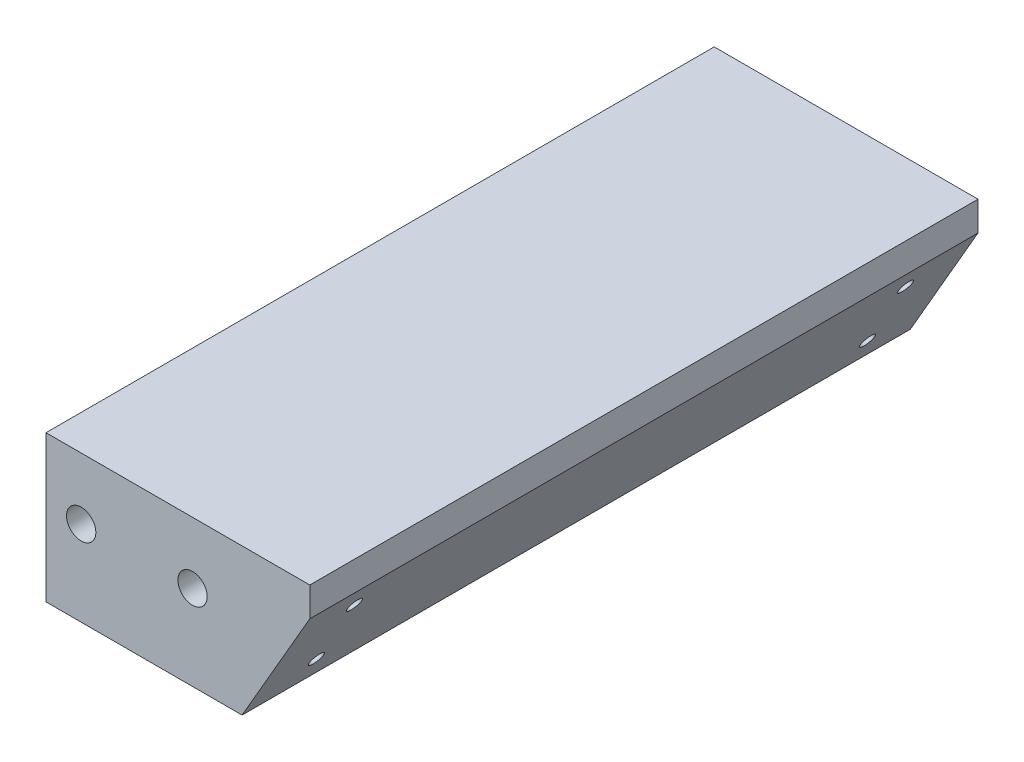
ISO-10303-21;
HEADER;
FILE_DESCRIPTION(('STEP AP214'),'2;1');
FILE_NAME('part.step','',(''),(''),'','','');
FILE_SCHEMA(('AUTOMOTIVE_DESIGN { 1 0 10303 214 1 1 1 1 }'));
ENDSEC;
DATA;
#1=APPLICATION_CONTEXT('core data for automotive mechanical design processes');
#2=APPLICATION_PROTOCOL_DEFINITION('international standard','automotive_design',2000,#1);
#3=PRODUCT_CONTEXT('',#1,'mechanical');
#4=PRODUCT('Part','Part','',(#3));
#5=PRODUCT_RELATED_PRODUCT_CATEGORY('part','',(#4));
#6=PRODUCT_DEFINITION_FORMATION('','',#4);
#7=PRODUCT_DEFINITION_CONTEXT('part definition',#1,'design');
#8=PRODUCT_DEFINITION('design','',#6,#7);
#9=PRODUCT_DEFINITION_SHAPE('','',#8);
#10=(LENGTH_UNIT() NAMED_UNIT(*) SI_UNIT(.MILLI.,.METRE.));
#11=(NAMED_UNIT(*) PLANE_ANGLE_UNIT() SI_UNIT($,.RADIAN.));
#12=(NAMED_UNIT(*) SI_UNIT($,.STERADIAN.) SOLID_ANGLE_UNIT());
#13=UNCERTAINTY_MEASURE_WITH_UNIT(LENGTH_MEASURE(1.E-05),#10,'distance_accuracy_value','');
#14=(GEOMETRIC_REPRESENTATION_CONTEXT(3) GLOBAL_UNCERTAINTY_ASSIGNED_CONTEXT((#13)) GLOBAL_UNIT_ASSIGNED_CONTEXT((#10,
#11,#12)) REPRESENTATION_CONTEXT('',''));
#15=CARTESIAN_POINT('',(0.,0.,0.));
#16=DIRECTION('',(0.,0.,1.));
#17=DIRECTION('',(1.,0.,0.));
#18=AXIS2_PLACEMENT_3D('',#15,#16,#17);
#19=CARTESIAN_POINT('',(45.,0.,57.));
#20=DIRECTION('',(0.,-1.,0.));
#21=DIRECTION('',(1.,0.,0.));
#22=AXIS2_PLACEMENT_3D('',#19,#20,#21);
#23=PLANE('',#22);
#24=DIRECTION('',(-1.,0.,0.));
#25=VECTOR('',#24,1.);
#26=CARTESIAN_POINT('',(45.,0.,-57.));
#27=LINE('',#26,#25);
#28=CARTESIAN_POINT('',(45.,0.,-57.));
#29=VERTEX_POINT('',#28);
#30=CARTESIAN_POINT('',(0.,0.,-57.));
#31=VERTEX_POINT('',#30);
#32=EDGE_CURVE('E113',#29,#31,#27,.T.);
#33=ORIENTED_EDGE('',*,*,#32,.T.);
#34=DIRECTION('',(0.,0.,-1.));
#35=VECTOR('',#34,1.);
#36=CARTESIAN_POINT('',(0.,0.,57.));
#37=LINE('',#36,#35);
#38=CARTESIAN_POINT('',(0.,0.,57.));
#39=VERTEX_POINT('',#38);
#40=EDGE_CURVE('E11',#39,#31,#37,.T.);
#41=ORIENTED_EDGE('',*,*,#40,.F.);
#42=DIRECTION('',(-1.,0.,0.));
#43=VECTOR('',#42,1.);
#44=CARTESIAN_POINT('',(45.,0.,57.));
#45=LINE('',#44,#43);
#46=CARTESIAN_POINT('',(45.,0.,57.));
#47=VERTEX_POINT('',#46);
#48=EDGE_CURVE('E122',#47,#39,#45,.T.);
#49=ORIENTED_EDGE('',*,*,#48,.F.);
#50=DIRECTION('',(0.,0.,-1.));
#51=VECTOR('',#50,1.);
#52=CARTESIAN_POINT('',(45.,0.,57.));
#53=LINE('',#52,#51);
#54=EDGE_CURVE('E109',#47,#29,#53,.T.);
#55=ORIENTED_EDGE('',*,*,#54,.T.);
#56=EDGE_LOOP('',(#33,#41,#49,#55));
#57=FACE_BOUND('',#56,.T.);
#58=ADVANCED_FACE('F36',(#57),#23,.F.);
#59=CARTESIAN_POINT('',(0.,0.,57.));
#60=DIRECTION('',(1.,0.,0.));
#61=DIRECTION('',(0.,1.,0.));
#62=AXIS2_PLACEMENT_3D('',#59,#60,#61);
#63=PLANE('',#62);
#64=DIRECTION('',(0.,-1.,0.));
#65=VECTOR('',#64,1.);
#66=CARTESIAN_POINT('',(0.,0.,-57.));
#67=LINE('',#66,#65);
#68=CARTESIAN_POINT('',(0.,-25.,-57.));
#69=VERTEX_POINT('',#68);
#70=EDGE_CURVE('E116',#31,#69,#67,.T.);
#71=ORIENTED_EDGE('',*,*,#70,.T.);
#72=DIRECTION('',(0.,0.,-1.));
#73=VECTOR('',#72,1.);
#74=CARTESIAN_POINT('',(0.,-25.,57.));
#75=LINE('',#74,#73);
#76=CARTESIAN_POINT('',(0.,-25.,57.));
#77=VERTEX_POINT('',#76);
#78=EDGE_CURVE('E44',#77,#69,#75,.T.);
#79=ORIENTED_EDGE('',*,*,#78,.F.);
#80=DIRECTION('',(0.,-1.,0.));
#81=VECTOR('',#80,1.);
#82=CARTESIAN_POINT('',(0.,0.,57.));
#83=LINE('',#82,#81);
#84=EDGE_CURVE('E87',#39,#77,#83,.T.);
#85=ORIENTED_EDGE('',*,*,#84,.F.);
#86=ORIENTED_EDGE('',*,*,#40,.T.);
#87=EDGE_LOOP('',(#71,#79,#85,#86));
#88=FACE_BOUND('',#87,.T.);
#89=ADVANCED_FACE('F143',(#88),#63,.F.);
#90=CARTESIAN_POINT('',(0.,-25.,57.));
#91=DIRECTION('',(0.,1.,0.));
#92=DIRECTION('',(0.,0.,1.));
#93=AXIS2_PLACEMENT_3D('',#90,#91,#92);
#94=PLANE('',#93);
#95=DIRECTION('',(1.,0.,0.));
#96=VECTOR('',#95,1.);
#97=CARTESIAN_POINT('',(0.,-25.,-57.));
#98=LINE('',#97,#96);
#99=CARTESIAN_POINT('',(33.4529946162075,-25.,-57.));
#100=VERTEX_POINT('',#99);
#101=EDGE_CURVE('E104',#69,#100,#98,.T.);
#102=ORIENTED_EDGE('',*,*,#101,.T.);
#103=DIRECTION('',(0.,0.,-1.));
#104=VECTOR('',#103,1.);
#105=CARTESIAN_POINT('',(33.4529946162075,-25.,57.));
#106=LINE('',#105,#104);
#107=CARTESIAN_POINT('',(33.4529946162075,-25.,57.));
#108=VERTEX_POINT('',#107);
#109=EDGE_CURVE('E101',#108,#100,#106,.T.);
#110=ORIENTED_EDGE('',*,*,#109,.F.);
#111=DIRECTION('',(1.,0.,0.));
#112=VECTOR('',#111,1.);
#113=CARTESIAN_POINT('',(0.,-25.,57.));
#114=LINE('',#113,#112);
#115=EDGE_CURVE('E93',#77,#108,#114,.T.);
#116=ORIENTED_EDGE('',*,*,#115,.F.);
#117=ORIENTED_EDGE('',*,*,#78,.T.);
#118=EDGE_LOOP('',(#102,#110,#116,#117));
#119=FACE_BOUND('',#118,.T.);
#120=ADVANCED_FACE('F102',(#119),#94,.F.);
#121=CARTESIAN_POINT('',(33.4529946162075,-25.,57.));
#122=DIRECTION('',(-0.86602540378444,0.499999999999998,0.));
#123=DIRECTION('',(-0.499999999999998,-0.86602540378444,0.));
#124=AXIS2_PLACEMENT_3D('',#121,#122,#123);
#125=PLANE('',#124);
#126=CARTESIAN_POINT('',(42.6188021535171,-9.12435565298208,47.));
#127=DIRECTION('',(0.86602540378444,-0.499999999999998,0.));
#128=DIRECTION('',(0.499999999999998,0.86602540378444,0.));
#129=AXIS2_PLACEMENT_3D('',#126,#127,#128);
#130=CIRCLE('',#129,1.24999999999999);
#131=CARTESIAN_POINT('',(43.2438021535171,-8.04182389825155,47.));
#132=VERTEX_POINT('',#131);
#133=EDGE_CURVE('E423',#132,#132,#130,.T.);
#134=ORIENTED_EDGE('',*,*,#133,.F.);
#135=EDGE_LOOP('',(#134));
#136=FACE_BOUND('',#135,.T.);
#137=CARTESIAN_POINT('',(42.6188021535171,-9.12435565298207,-47.));
#138=DIRECTION('',(0.86602540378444,-0.499999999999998,0.));
#139=DIRECTION('',(0.499999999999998,0.86602540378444,0.));
#140=AXIS2_PLACEMENT_3D('',#137,#138,#139);
#141=CIRCLE('',#140,1.24999999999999);
#142=CARTESIAN_POINT('',(43.2438021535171,-8.04182389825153,-47.));
#143=VERTEX_POINT('',#142);
#144=EDGE_CURVE('E417',#143,#143,#141,.T.);
#145=ORIENTED_EDGE('',*,*,#144,.F.);
#146=EDGE_LOOP('',(#145));
#147=FACE_BOUND('',#146,.T.);
#148=CARTESIAN_POINT('',(36.1295104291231,-20.3641386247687,-47.));
#149=DIRECTION('',(0.86602540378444,-0.499999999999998,0.));
#150=DIRECTION('',(0.499999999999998,0.86602540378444,0.));
#151=AXIS2_PLACEMENT_3D('',#148,#149,#150);
#152=CIRCLE('',#151,1.24999999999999);
#153=CARTESIAN_POINT('',(36.7545104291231,-19.2816068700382,-47.));
#154=VERTEX_POINT('',#153);
#155=EDGE_CURVE('E411',#154,#154,#152,.T.);
#156=ORIENTED_EDGE('',*,*,#155,.F.);
#157=EDGE_LOOP('',(#156));
#158=FACE_BOUND('',#157,.T.);
#159=CARTESIAN_POINT('',(36.1295104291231,-20.3641386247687,47.));
#160=DIRECTION('',(0.86602540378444,-0.499999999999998,0.));
#161=DIRECTION('',(0.499999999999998,0.86602540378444,0.));
#162=AXIS2_PLACEMENT_3D('',#159,#160,#161);
#163=CIRCLE('',#162,1.24999999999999);
#164=CARTESIAN_POINT('',(36.7545104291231,-19.2816068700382,47.));
#165=VERTEX_POINT('',#164);
#166=EDGE_CURVE('E405',#165,#165,#163,.T.);
#167=ORIENTED_EDGE('',*,*,#166,.F.);
#168=EDGE_LOOP('',(#167));
#169=FACE_BOUND('',#168,.T.);
#170=DIRECTION('',(0.499999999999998,0.86602540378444,0.));
#171=VECTOR('',#170,1.);
#172=CARTESIAN_POINT('',(33.4529946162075,-25.,-57.));
#173=LINE('',#172,#171);
#174=CARTESIAN_POINT('',(45.,-5.,-57.));
#175=VERTEX_POINT('',#174);
#176=EDGE_CURVE('E73',#100,#175,#173,.T.);
#177=ORIENTED_EDGE('',*,*,#176,.T.);
#178=DIRECTION('',(0.,0.,-1.));
#179=VECTOR('',#178,1.);
#180=CARTESIAN_POINT('',(45.,-5.,57.));
#181=LINE('',#180,#179);
#182=CARTESIAN_POINT('',(45.,-5.,57.));
#183=VERTEX_POINT('',#182);
#184=EDGE_CURVE('E105',#183,#175,#181,.T.);
#185=ORIENTED_EDGE('',*,*,#184,.F.);
#186=DIRECTION('',(0.499999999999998,0.86602540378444,0.));
#187=VECTOR('',#186,1.);
#188=CARTESIAN_POINT('',(33.4529946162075,-25.,57.));
#189=LINE('',#188,#187);
#190=EDGE_CURVE('E97',#108,#183,#189,.T.);
#191=ORIENTED_EDGE('',*,*,#190,.F.);
#192=ORIENTED_EDGE('',*,*,#109,.T.);
#193=EDGE_LOOP('',(#177,#185,#191,#192));
#194=FACE_BOUND('',#193,.T.);
#195=ADVANCED_FACE('F107',(#136,#147,#158,#169,#194),#125,.F.);
#196=CARTESIAN_POINT('',(45.,-5.,57.));
#197=DIRECTION('',(-1.,0.,0.));
#198=DIRECTION('',(0.,0.,1.));
#199=AXIS2_PLACEMENT_3D('',#196,#197,#198);
#200=PLANE('',#199);
#201=DIRECTION('',(0.,1.,0.));
#202=VECTOR('',#201,1.);
#203=CARTESIAN_POINT('',(45.,-5.,-57.));
#204=LINE('',#203,#202);
#205=EDGE_CURVE('E79',#175,#29,#204,.T.);
#206=ORIENTED_EDGE('',*,*,#205,.T.);
#207=ORIENTED_EDGE('',*,*,#54,.F.);
#208=DIRECTION('',(0.,1.,0.));
#209=VECTOR('',#208,1.);
#210=CARTESIAN_POINT('',(45.,-5.,57.));
#211=LINE('',#210,#209);
#212=EDGE_CURVE('E52',#183,#47,#211,.T.);
#213=ORIENTED_EDGE('',*,*,#212,.F.);
#214=ORIENTED_EDGE('',*,*,#184,.T.);
#215=EDGE_LOOP('',(#206,#207,#213,#214));
#216=FACE_BOUND('',#215,.T.);
#217=ADVANCED_FACE('F130',(#216),#200,.F.);
#218=CARTESIAN_POINT('',(0.,0.,57.));
#219=DIRECTION('',(0.,0.,1.));
#220=DIRECTION('',(1.,0.,0.));
#221=AXIS2_PLACEMENT_3D('',#218,#219,#220);
#222=PLANE('',#221);
#223=CARTESIAN_POINT('',(25.,-10.5,57.));
#224=DIRECTION('',(0.,0.,1.));
#225=DIRECTION('',(1.,0.,0.));
#226=AXIS2_PLACEMENT_3D('',#223,#224,#225);
#227=CIRCLE('',#226,2.49999999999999);
#228=CARTESIAN_POINT('',(27.5,-10.5,57.));
#229=VERTEX_POINT('',#228);
#230=EDGE_CURVE('E376',#229,#229,#227,.T.);
#231=ORIENTED_EDGE('',*,*,#230,.F.);
#232=EDGE_LOOP('',(#231));
#233=FACE_BOUND('',#232,.T.);
#234=CARTESIAN_POINT('',(6.,-10.5,57.));
#235=DIRECTION('',(0.,0.,1.));
#236=DIRECTION('',(1.,0.,0.));
#237=AXIS2_PLACEMENT_3D('',#234,#235,#236);
#238=CIRCLE('',#237,2.49999999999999);
#239=CARTESIAN_POINT('',(8.49999999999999,-10.5,57.));
#240=VERTEX_POINT('',#239);
#241=EDGE_CURVE('E387',#240,#240,#238,.T.);
#242=ORIENTED_EDGE('',*,*,#241,.F.);
#243=EDGE_LOOP('',(#242));
#244=FACE_BOUND('',#243,.T.);
#245=ORIENTED_EDGE('',*,*,#48,.T.);
#246=ORIENTED_EDGE('',*,*,#84,.T.);
#247=ORIENTED_EDGE('',*,*,#115,.T.);
#248=ORIENTED_EDGE('',*,*,#190,.T.);
#249=ORIENTED_EDGE('',*,*,#212,.T.);
#250=EDGE_LOOP('',(#245,#246,#247,#248,#249));
#251=FACE_BOUND('',#250,.T.);
#252=ADVANCED_FACE('F95',(#233,#244,#251),#222,.T.);
#253=CARTESIAN_POINT('',(0.,0.,-57.));
#254=DIRECTION('',(0.,0.,1.));
#255=DIRECTION('',(1.,0.,0.));
#256=AXIS2_PLACEMENT_3D('',#253,#254,#255);
#257=PLANE('',#256);
#258=CARTESIAN_POINT('',(25.,-10.5,-57.));
#259=DIRECTION('',(0.,0.,-1.));
#260=DIRECTION('',(-1.,0.,0.));
#261=AXIS2_PLACEMENT_3D('',#258,#259,#260);
#262=CIRCLE('',#261,2.49999999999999);
#263=CARTESIAN_POINT('',(22.5,-10.5,-57.));
#264=VERTEX_POINT('',#263);
#265=EDGE_CURVE('E367',#264,#264,#262,.T.);
#266=ORIENTED_EDGE('',*,*,#265,.F.);
#267=EDGE_LOOP('',(#266));
#268=FACE_BOUND('',#267,.T.);
#269=CARTESIAN_POINT('',(6.,-10.5,-57.));
#270=DIRECTION('',(0.,0.,-1.));
#271=DIRECTION('',(-1.,0.,0.));
#272=AXIS2_PLACEMENT_3D('',#269,#270,#271);
#273=CIRCLE('',#272,2.49999999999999);
#274=CARTESIAN_POINT('',(3.50000000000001,-10.5,-57.));
#275=VERTEX_POINT('',#274);
#276=EDGE_CURVE('E370',#275,#275,#273,.T.);
#277=ORIENTED_EDGE('',*,*,#276,.F.);
#278=EDGE_LOOP('',(#277));
#279=FACE_BOUND('',#278,.T.);
#280=ORIENTED_EDGE('',*,*,#32,.F.);
#281=ORIENTED_EDGE('',*,*,#205,.F.);
#282=ORIENTED_EDGE('',*,*,#176,.F.);
#283=ORIENTED_EDGE('',*,*,#101,.F.);
#284=ORIENTED_EDGE('',*,*,#70,.F.);
#285=EDGE_LOOP('',(#280,#281,#282,#283,#284));
#286=FACE_BOUND('',#285,.T.);
#287=ADVANCED_FACE('F126',(#268,#279,#286),#257,.F.);
#288=CARTESIAN_POINT('',(6.,-10.5,42.));
#289=DIRECTION('',(0.,0.,1.));
#290=DIRECTION('',(1.,0.,0.));
#291=AXIS2_PLACEMENT_3D('',#288,#289,#290);
#292=CONICAL_SURFACE('',#291,2.49999999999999,1.02974425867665);
#293=CARTESIAN_POINT('',(5.99999999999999,-10.5,40.4978484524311));
#294=VERTEX_POINT('',#293);
#295=VERTEX_LOOP('',#294);
#296=FACE_BOUND('',#295,.T.);
#297=CARTESIAN_POINT('',(6.,-10.5,42.));
#298=DIRECTION('',(0.,0.,1.));
#299=DIRECTION('',(1.,0.,0.));
#300=AXIS2_PLACEMENT_3D('',#297,#298,#299);
#301=CIRCLE('',#300,2.49999999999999);
#302=CARTESIAN_POINT('',(8.49999999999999,-10.5,42.));
#303=VERTEX_POINT('',#302);
#304=EDGE_CURVE('E117',#303,#303,#301,.T.);
#305=ORIENTED_EDGE('',*,*,#304,.T.);
#306=EDGE_LOOP('',(#305));
#307=FACE_BOUND('',#306,.T.);
#308=ADVANCED_FACE('F286',(#296,#307),#292,.F.);
#309=CARTESIAN_POINT('',(6.,-10.5,57.));
#310=DIRECTION('',(0.,0.,1.));
#311=DIRECTION('',(1.,0.,0.));
#312=AXIS2_PLACEMENT_3D('',#309,#310,#311);
#313=CYLINDRICAL_SURFACE('',#312,2.49999999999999);
#314=ORIENTED_EDGE('',*,*,#304,.F.);
#315=EDGE_LOOP('',(#314));
#316=FACE_BOUND('',#315,.T.);
#317=ORIENTED_EDGE('',*,*,#241,.T.);
#318=EDGE_LOOP('',(#317));
#319=FACE_BOUND('',#318,.T.);
#320=ADVANCED_FACE('F280',(#316,#319),#313,.F.);
#321=CARTESIAN_POINT('',(25.,-10.5,42.));
#322=DIRECTION('',(0.,0.,1.));
#323=DIRECTION('',(1.,0.,0.));
#324=AXIS2_PLACEMENT_3D('',#321,#322,#323);
#325=CONICAL_SURFACE('',#324,2.49999999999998,1.02974425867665);
#326=CARTESIAN_POINT('',(25.,-10.5,40.4978484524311));
#327=VERTEX_POINT('',#326);
#328=VERTEX_LOOP('',#327);
#329=FACE_BOUND('',#328,.T.);
#330=CARTESIAN_POINT('',(25.,-10.5,42.));
#331=DIRECTION('',(0.,0.,1.));
#332=DIRECTION('',(1.,0.,0.));
#333=AXIS2_PLACEMENT_3D('',#330,#331,#332);
#334=CIRCLE('',#333,2.49999999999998);
#335=CARTESIAN_POINT('',(27.5,-10.5,42.));
#336=VERTEX_POINT('',#335);
#337=EDGE_CURVE('E384',#336,#336,#334,.T.);
#338=ORIENTED_EDGE('',*,*,#337,.T.);
#339=EDGE_LOOP('',(#338));
#340=FACE_BOUND('',#339,.T.);
#341=ADVANCED_FACE('F285',(#329,#340),#325,.F.);
#342=CARTESIAN_POINT('',(25.,-10.5,57.));
#343=DIRECTION('',(0.,0.,1.));
#344=DIRECTION('',(1.,0.,0.));
#345=AXIS2_PLACEMENT_3D('',#342,#343,#344);
#346=CYLINDRICAL_SURFACE('',#345,2.49999999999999);
#347=ORIENTED_EDGE('',*,*,#337,.F.);
#348=EDGE_LOOP('',(#347));
#349=FACE_BOUND('',#348,.T.);
#350=ORIENTED_EDGE('',*,*,#230,.T.);
#351=EDGE_LOOP('',(#350));
#352=FACE_BOUND('',#351,.T.);
#353=ADVANCED_FACE('F294',(#349,#352),#346,.F.);
#354=CARTESIAN_POINT('',(6.,-10.5,-42.));
#355=DIRECTION('',(0.,0.,-1.));
#356=DIRECTION('',(-1.,0.,0.));
#357=AXIS2_PLACEMENT_3D('',#354,#355,#356);
#358=CONICAL_SURFACE('',#357,2.49999999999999,1.02974425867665);
#359=CARTESIAN_POINT('',(5.99999999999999,-10.5,-40.4978484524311));
#360=VERTEX_POINT('',#359);
#361=VERTEX_LOOP('',#360);
#362=FACE_BOUND('',#361,.T.);
#363=CARTESIAN_POINT('',(6.,-10.5,-42.));
#364=DIRECTION('',(0.,0.,-1.));
#365=DIRECTION('',(-1.,0.,0.));
#366=AXIS2_PLACEMENT_3D('',#363,#364,#365);
#367=CIRCLE('',#366,2.49999999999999);
#368=CARTESIAN_POINT('',(3.50000000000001,-10.5,-42.));
#369=VERTEX_POINT('',#368);
#370=EDGE_CURVE('E372',#369,#369,#367,.T.);
#371=ORIENTED_EDGE('',*,*,#370,.T.);
#372=EDGE_LOOP('',(#371));
#373=FACE_BOUND('',#372,.T.);
#374=ADVANCED_FACE('F265',(#362,#373),#358,.F.);
#375=CARTESIAN_POINT('',(6.,-10.5,-57.));
#376=DIRECTION('',(0.,0.,-1.));
#377=DIRECTION('',(-1.,0.,0.));
#378=AXIS2_PLACEMENT_3D('',#375,#376,#377);
#379=CYLINDRICAL_SURFACE('',#378,2.49999999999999);
#380=ORIENTED_EDGE('',*,*,#370,.F.);
#381=EDGE_LOOP('',(#380));
#382=FACE_BOUND('',#381,.T.);
#383=ORIENTED_EDGE('',*,*,#276,.T.);
#384=EDGE_LOOP('',(#383));
#385=FACE_BOUND('',#384,.T.);
#386=ADVANCED_FACE('F259',(#382,#385),#379,.F.);
#387=CARTESIAN_POINT('',(25.,-10.5,-42.));
#388=DIRECTION('',(0.,0.,-1.));
#389=DIRECTION('',(-1.,0.,0.));
#390=AXIS2_PLACEMENT_3D('',#387,#388,#389);
#391=CONICAL_SURFACE('',#390,2.49999999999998,1.02974425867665);
#392=CARTESIAN_POINT('',(25.,-10.5,-40.4978484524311));
#393=VERTEX_POINT('',#392);
#394=VERTEX_LOOP('',#393);
#395=FACE_BOUND('',#394,.T.);
#396=CARTESIAN_POINT('',(25.,-10.5,-42.));
#397=DIRECTION('',(0.,0.,-1.));
#398=DIRECTION('',(-1.,0.,0.));
#399=AXIS2_PLACEMENT_3D('',#396,#397,#398);
#400=CIRCLE('',#399,2.49999999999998);
#401=CARTESIAN_POINT('',(22.5,-10.5,-42.));
#402=VERTEX_POINT('',#401);
#403=EDGE_CURVE('E373',#402,#402,#400,.T.);
#404=ORIENTED_EDGE('',*,*,#403,.T.);
#405=EDGE_LOOP('',(#404));
#406=FACE_BOUND('',#405,.T.);
#407=ADVANCED_FACE('F264',(#395,#406),#391,.F.);
#408=CARTESIAN_POINT('',(25.,-10.5,-57.));
#409=DIRECTION('',(0.,0.,-1.));
#410=DIRECTION('',(-1.,0.,0.));
#411=AXIS2_PLACEMENT_3D('',#408,#409,#410);
#412=CYLINDRICAL_SURFACE('',#411,2.49999999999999);
#413=ORIENTED_EDGE('',*,*,#403,.F.);
#414=EDGE_LOOP('',(#413));
#415=FACE_BOUND('',#414,.T.);
#416=ORIENTED_EDGE('',*,*,#265,.T.);
#417=EDGE_LOOP('',(#416));
#418=FACE_BOUND('',#417,.T.);
#419=ADVANCED_FACE('F164',(#415,#418),#412,.F.);
#420=CARTESIAN_POINT('',(25.7372055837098,-14.3641386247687,47.));
#421=DIRECTION('',(0.86602540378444,-0.499999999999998,0.));
#422=DIRECTION('',(0.499999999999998,0.86602540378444,0.));
#423=AXIS2_PLACEMENT_3D('',#420,#421,#422);
#424=CONICAL_SURFACE('',#423,1.24999999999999,1.02974425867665);
#425=CARTESIAN_POINT('',(25.0867548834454,-13.9886007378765,47.));
#426=VERTEX_POINT('',#425);
#427=VERTEX_LOOP('',#426);
#428=FACE_BOUND('',#427,.T.);
#429=CARTESIAN_POINT('',(25.7372055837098,-14.3641386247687,47.));
#430=DIRECTION('',(0.86602540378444,-0.499999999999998,0.));
#431=DIRECTION('',(0.499999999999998,0.86602540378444,0.));
#432=AXIS2_PLACEMENT_3D('',#429,#430,#431);
#433=CIRCLE('',#432,1.24999999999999);
#434=CARTESIAN_POINT('',(26.3622055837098,-13.2816068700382,47.));
#435=VERTEX_POINT('',#434);
#436=EDGE_CURVE('E402',#435,#435,#433,.T.);
#437=ORIENTED_EDGE('',*,*,#436,.T.);
#438=EDGE_LOOP('',(#437));
#439=FACE_BOUND('',#438,.T.);
#440=ADVANCED_FACE('F169',(#428,#439),#424,.F.);
#441=CARTESIAN_POINT('',(36.1295104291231,-20.3641386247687,47.));
#442=DIRECTION('',(0.86602540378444,-0.499999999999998,0.));
#443=DIRECTION('',(0.499999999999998,0.86602540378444,0.));
#444=AXIS2_PLACEMENT_3D('',#441,#442,#443);
#445=CYLINDRICAL_SURFACE('',#444,1.24999999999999);
#446=ORIENTED_EDGE('',*,*,#436,.F.);
#447=EDGE_LOOP('',(#446));
#448=FACE_BOUND('',#447,.T.);
#449=ORIENTED_EDGE('',*,*,#166,.T.);
#450=EDGE_LOOP('',(#449));
#451=FACE_BOUND('',#450,.T.);
#452=ADVANCED_FACE('F174',(#448,#451),#445,.F.);
#453=CARTESIAN_POINT('',(25.7372055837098,-14.3641386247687,-47.));
#454=DIRECTION('',(0.86602540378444,-0.499999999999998,0.));
#455=DIRECTION('',(0.499999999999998,0.86602540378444,0.));
#456=AXIS2_PLACEMENT_3D('',#453,#454,#455);
#457=CONICAL_SURFACE('',#456,1.24999999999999,1.02974425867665);
#458=CARTESIAN_POINT('',(25.0867548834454,-13.9886007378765,-47.));
#459=VERTEX_POINT('',#458);
#460=VERTEX_LOOP('',#459);
#461=FACE_BOUND('',#460,.T.);
#462=CARTESIAN_POINT('',(25.7372055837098,-14.3641386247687,-47.));
#463=DIRECTION('',(0.86602540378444,-0.499999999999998,0.));
#464=DIRECTION('',(0.499999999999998,0.86602540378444,0.));
#465=AXIS2_PLACEMENT_3D('',#462,#463,#464);
#466=CIRCLE('',#465,1.24999999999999);
#467=CARTESIAN_POINT('',(26.3622055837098,-13.2816068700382,-47.));
#468=VERTEX_POINT('',#467);
#469=EDGE_CURVE('E408',#468,#468,#466,.T.);
#470=ORIENTED_EDGE('',*,*,#469,.T.);
#471=EDGE_LOOP('',(#470));
#472=FACE_BOUND('',#471,.T.);
#473=ADVANCED_FACE('F186',(#461,#472),#457,.F.);
#474=CARTESIAN_POINT('',(36.1295104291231,-20.3641386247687,-47.));
#475=DIRECTION('',(0.86602540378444,-0.499999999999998,0.));
#476=DIRECTION('',(0.499999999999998,0.86602540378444,0.));
#477=AXIS2_PLACEMENT_3D('',#474,#475,#476);
#478=CYLINDRICAL_SURFACE('',#477,1.24999999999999);
#479=ORIENTED_EDGE('',*,*,#469,.F.);
#480=EDGE_LOOP('',(#479));
#481=FACE_BOUND('',#480,.T.);
#482=ORIENTED_EDGE('',*,*,#155,.T.);
#483=EDGE_LOOP('',(#482));
#484=FACE_BOUND('',#483,.T.);
#485=ADVANCED_FACE('F198',(#481,#484),#478,.F.);
#486=CARTESIAN_POINT('',(32.2264973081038,-3.1243556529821,-47.));
#487=DIRECTION('',(0.86602540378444,-0.499999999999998,0.));
#488=DIRECTION('',(0.499999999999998,0.86602540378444,0.));
#489=AXIS2_PLACEMENT_3D('',#486,#487,#488);
#490=CONICAL_SURFACE('',#489,1.24999999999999,1.02974425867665);
#491=CARTESIAN_POINT('',(31.5760466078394,-2.74881776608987,-47.));
#492=VERTEX_POINT('',#491);
#493=VERTEX_LOOP('',#492);
#494=FACE_BOUND('',#493,.T.);
#495=CARTESIAN_POINT('',(32.2264973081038,-3.1243556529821,-47.));
#496=DIRECTION('',(0.86602540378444,-0.499999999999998,0.));
#497=DIRECTION('',(0.499999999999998,0.86602540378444,0.));
#498=AXIS2_PLACEMENT_3D('',#495,#496,#497);
#499=CIRCLE('',#498,1.24999999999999);
#500=CARTESIAN_POINT('',(32.8514973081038,-2.04182389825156,-47.));
#501=VERTEX_POINT('',#500);
#502=EDGE_CURVE('E414',#501,#501,#499,.T.);
#503=ORIENTED_EDGE('',*,*,#502,.T.);
#504=EDGE_LOOP('',(#503));
#505=FACE_BOUND('',#504,.T.);
#506=ADVANCED_FACE('F208',(#494,#505),#490,.F.);
#507=CARTESIAN_POINT('',(42.6188021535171,-9.12435565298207,-47.));
#508=DIRECTION('',(0.86602540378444,-0.499999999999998,0.));
#509=DIRECTION('',(0.499999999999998,0.86602540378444,0.));
#510=AXIS2_PLACEMENT_3D('',#507,#508,#509);
#511=CYLINDRICAL_SURFACE('',#510,1.24999999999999);
#512=ORIENTED_EDGE('',*,*,#502,.F.);
#513=EDGE_LOOP('',(#512));
#514=FACE_BOUND('',#513,.T.);
#515=ORIENTED_EDGE('',*,*,#144,.T.);
#516=EDGE_LOOP('',(#515));
#517=FACE_BOUND('',#516,.T.);
#518=ADVANCED_FACE('F220',(#514,#517),#511,.F.);
#519=CARTESIAN_POINT('',(32.2264973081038,-3.12435565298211,47.));
#520=DIRECTION('',(0.86602540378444,-0.499999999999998,0.));
#521=DIRECTION('',(0.499999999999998,0.86602540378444,0.));
#522=AXIS2_PLACEMENT_3D('',#519,#520,#521);
#523=CONICAL_SURFACE('',#522,1.24999999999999,1.02974425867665);
#524=CARTESIAN_POINT('',(31.5760466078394,-2.74881776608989,47.));
#525=VERTEX_POINT('',#524);
#526=VERTEX_LOOP('',#525);
#527=FACE_BOUND('',#526,.T.);
#528=CARTESIAN_POINT('',(32.2264973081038,-3.12435565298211,47.));
#529=DIRECTION('',(0.86602540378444,-0.499999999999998,0.));
#530=DIRECTION('',(0.499999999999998,0.86602540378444,0.));
#531=AXIS2_PLACEMENT_3D('',#528,#529,#530);
#532=CIRCLE('',#531,1.24999999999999);
#533=CARTESIAN_POINT('',(32.8514973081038,-2.04182389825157,47.));
#534=VERTEX_POINT('',#533);
#535=EDGE_CURVE('E420',#534,#534,#532,.T.);
#536=ORIENTED_EDGE('',*,*,#535,.T.);
#537=EDGE_LOOP('',(#536));
#538=FACE_BOUND('',#537,.T.);
#539=ADVANCED_FACE('F230',(#527,#538),#523,.F.);
#540=CARTESIAN_POINT('',(42.6188021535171,-9.12435565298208,47.));
#541=DIRECTION('',(0.86602540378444,-0.499999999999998,0.));
#542=DIRECTION('',(0.499999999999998,0.86602540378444,0.));
#543=AXIS2_PLACEMENT_3D('',#540,#541,#542);
#544=CYLINDRICAL_SURFACE('',#543,1.24999999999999);
#545=ORIENTED_EDGE('',*,*,#535,.F.);
#546=EDGE_LOOP('',(#545));
#547=FACE_BOUND('',#546,.T.);
#548=ORIENTED_EDGE('',*,*,#133,.T.);
#549=EDGE_LOOP('',(#548));
#550=FACE_BOUND('',#549,.T.);
#551=ADVANCED_FACE('F242',(#547,#550),#544,.F.);
#552=CLOSED_SHELL('',(#58,#89,#120,#195,#217,#252,#287,#308,#320,#341,#353,#374,#386,#407,#419,
#440,#452,#473,#485,#506,#518,#539,#551));
#553=MANIFOLD_SOLID_BREP('B2',#552);
#554=ADVANCED_BREP_SHAPE_REPRESENTATION('',(#18,#553),#14);
#555=SHAPE_DEFINITION_REPRESENTATION(#9,#554);
ENDSEC;
END-ISO-10303-21;
